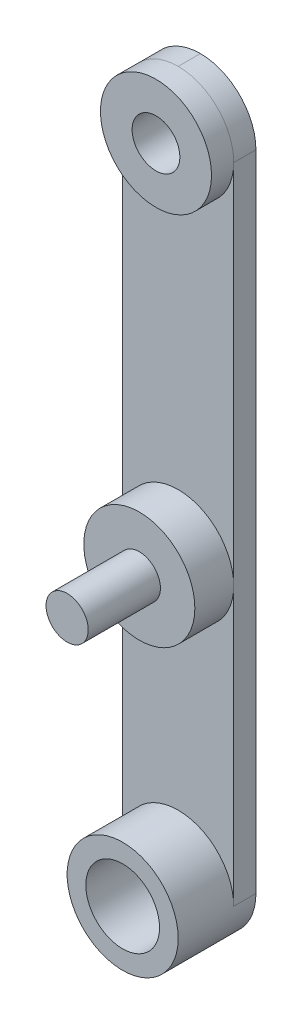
ISO-10303-21;
HEADER;
FILE_DESCRIPTION(('STEP AP214'),'2;1');
FILE_NAME('part.step','',(''),(''),'','','');
FILE_SCHEMA(('AUTOMOTIVE_DESIGN { 1 0 10303 214 1 1 1 1 }'));
ENDSEC;
DATA;
#1=APPLICATION_CONTEXT('core data for automotive mechanical design processes');
#2=APPLICATION_PROTOCOL_DEFINITION('international standard','automotive_design',2000,#1);
#3=PRODUCT_CONTEXT('',#1,'mechanical');
#4=PRODUCT('Part','Part','',(#3));
#5=PRODUCT_RELATED_PRODUCT_CATEGORY('part','',(#4));
#6=PRODUCT_DEFINITION_FORMATION('','',#4);
#7=PRODUCT_DEFINITION_CONTEXT('part definition',#1,'design');
#8=PRODUCT_DEFINITION('design','',#6,#7);
#9=PRODUCT_DEFINITION_SHAPE('','',#8);
#10=(LENGTH_UNIT() NAMED_UNIT(*) SI_UNIT(.MILLI.,.METRE.));
#11=(NAMED_UNIT(*) PLANE_ANGLE_UNIT() SI_UNIT($,.RADIAN.));
#12=(NAMED_UNIT(*) SI_UNIT($,.STERADIAN.) SOLID_ANGLE_UNIT());
#13=UNCERTAINTY_MEASURE_WITH_UNIT(LENGTH_MEASURE(1.E-05),#10,'distance_accuracy_value','');
#14=(GEOMETRIC_REPRESENTATION_CONTEXT(3) GLOBAL_UNCERTAINTY_ASSIGNED_CONTEXT((#13)) GLOBAL_UNIT_ASSIGNED_CONTEXT((#10,
#11,#12)) REPRESENTATION_CONTEXT('',''));
#15=CARTESIAN_POINT('',(0.,0.,0.));
#16=DIRECTION('',(0.,0.,1.));
#17=DIRECTION('',(1.,0.,0.));
#18=AXIS2_PLACEMENT_3D('',#15,#16,#17);
#19=CARTESIAN_POINT('',(0.,-25.,2.));
#20=DIRECTION('',(0.,0.,1.));
#21=DIRECTION('',(1.,0.,0.));
#22=AXIS2_PLACEMENT_3D('',#19,#20,#21);
#23=PLANE('',#22);
#24=DIRECTION('',(0.,1.,0.));
#25=VECTOR('',#24,1.);
#26=CARTESIAN_POINT('',(5.,38.,2.));
#27=LINE('',#26,#25);
#28=CARTESIAN_POINT('',(5.00000000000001,0.,2.));
#29=VERTEX_POINT('',#28);
#30=CARTESIAN_POINT('',(5.,33.,2.));
#31=VERTEX_POINT('',#30);
#32=EDGE_CURVE('E96',#29,#31,#27,.T.);
#33=ORIENTED_EDGE('',*,*,#32,.T.);
#34=CARTESIAN_POINT('',(0.,33.,2.));
#35=DIRECTION('',(0.,0.,1.));
#36=DIRECTION('',(1.,0.,0.));
#37=AXIS2_PLACEMENT_3D('',#34,#35,#36);
#38=CIRCLE('',#37,5.);
#39=CARTESIAN_POINT('',(-5.,33.,2.));
#40=VERTEX_POINT('',#39);
#41=EDGE_CURVE('E158',#31,#40,#38,.F.);
#42=ORIENTED_EDGE('',*,*,#41,.T.);
#43=DIRECTION('',(0.,-1.,0.));
#44=VECTOR('',#43,1.);
#45=CARTESIAN_POINT('',(-5.,38.,2.));
#46=LINE('',#45,#44);
#47=CARTESIAN_POINT('',(-5.,0.,2.));
#48=VERTEX_POINT('',#47);
#49=EDGE_CURVE('E148',#40,#48,#46,.T.);
#50=ORIENTED_EDGE('',*,*,#49,.T.);
#51=CARTESIAN_POINT('',(0.,0.,2.));
#52=DIRECTION('',(0.,0.,1.));
#53=DIRECTION('',(1.,0.,0.));
#54=AXIS2_PLACEMENT_3D('',#51,#52,#53);
#55=CIRCLE('',#54,5.);
#56=EDGE_CURVE('E141',#29,#48,#55,.T.);
#57=ORIENTED_EDGE('',*,*,#56,.F.);
#58=EDGE_LOOP('',(#33,#42,#50,#57));
#59=FACE_BOUND('',#58,.T.);
#60=ADVANCED_FACE('F35',(#59),#23,.T.);
#61=CARTESIAN_POINT('',(-4.99999999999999,-25.,2.));
#62=VERTEX_POINT('',#61);
#63=EDGE_CURVE('E113',#48,#62,#46,.T.);
#64=ORIENTED_EDGE('',*,*,#63,.T.);
#65=CARTESIAN_POINT('',(0.,-25.,2.));
#66=DIRECTION('',(0.,0.,1.));
#67=DIRECTION('',(1.,0.,0.));
#68=AXIS2_PLACEMENT_3D('',#65,#66,#67);
#69=CIRCLE('',#68,5.);
#70=CARTESIAN_POINT('',(5.00000000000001,-25.,2.));
#71=VERTEX_POINT('',#70);
#72=EDGE_CURVE('E106',#71,#62,#69,.T.);
#73=ORIENTED_EDGE('',*,*,#72,.F.);
#74=EDGE_CURVE('E90',#71,#29,#27,.T.);
#75=ORIENTED_EDGE('',*,*,#74,.T.);
#76=EDGE_CURVE('E135',#48,#29,#55,.T.);
#77=ORIENTED_EDGE('',*,*,#76,.F.);
#78=EDGE_LOOP('',(#64,#73,#75,#77));
#79=FACE_BOUND('',#78,.T.);
#80=ADVANCED_FACE('F111',(#79),#23,.T.);
#81=CARTESIAN_POINT('',(-5.,38.,2.));
#82=DIRECTION('',(1.,0.,0.));
#83=DIRECTION('',(0.,1.,0.));
#84=AXIS2_PLACEMENT_3D('',#81,#82,#83);
#85=PLANE('',#84);
#86=ORIENTED_EDGE('',*,*,#49,.F.);
#87=DIRECTION('',(0.,0.,-1.));
#88=VECTOR('',#87,1.);
#89=CARTESIAN_POINT('',(-5.,33.,2.));
#90=LINE('',#89,#88);
#91=CARTESIAN_POINT('',(-5.,33.,0.));
#92=VERTEX_POINT('',#91);
#93=EDGE_CURVE('E11',#40,#92,#90,.T.);
#94=ORIENTED_EDGE('',*,*,#93,.T.);
#95=DIRECTION('',(0.,-1.,0.));
#96=VECTOR('',#95,1.);
#97=CARTESIAN_POINT('',(-5.,38.,0.));
#98=LINE('',#97,#96);
#99=CARTESIAN_POINT('',(-4.99999999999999,-25.,0.));
#100=VERTEX_POINT('',#99);
#101=EDGE_CURVE('E147',#92,#100,#98,.T.);
#102=ORIENTED_EDGE('',*,*,#101,.T.);
#103=DIRECTION('',(0.,0.,-1.));
#104=VECTOR('',#103,1.);
#105=CARTESIAN_POINT('',(-4.99999999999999,-25.,2.));
#106=LINE('',#105,#104);
#107=EDGE_CURVE('E109',#62,#100,#106,.T.);
#108=ORIENTED_EDGE('',*,*,#107,.F.);
#109=ORIENTED_EDGE('',*,*,#63,.F.);
#110=EDGE_LOOP('',(#86,#94,#102,#108,#109));
#111=FACE_BOUND('',#110,.T.);
#112=ADVANCED_FACE('F175',(#111),#85,.F.);
#113=CARTESIAN_POINT('',(0.,-25.,2.));
#114=DIRECTION('',(0.,0.,-1.));
#115=DIRECTION('',(-1.,0.,0.));
#116=AXIS2_PLACEMENT_3D('',#113,#114,#115);
#117=CYLINDRICAL_SURFACE('',#116,5.);
#118=CARTESIAN_POINT('',(0.,-25.,0.));
#119=DIRECTION('',(0.,0.,1.));
#120=DIRECTION('',(1.,0.,0.));
#121=AXIS2_PLACEMENT_3D('',#118,#119,#120);
#122=CIRCLE('',#121,5.);
#123=CARTESIAN_POINT('',(5.00000000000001,-25.,0.));
#124=VERTEX_POINT('',#123);
#125=EDGE_CURVE('E108',#100,#124,#122,.T.);
#126=ORIENTED_EDGE('',*,*,#125,.T.);
#127=DIRECTION('',(0.,0.,-1.));
#128=VECTOR('',#127,1.);
#129=CARTESIAN_POINT('',(5.00000000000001,-25.,2.));
#130=LINE('',#129,#128);
#131=EDGE_CURVE('E93',#71,#124,#130,.T.);
#132=ORIENTED_EDGE('',*,*,#131,.F.);
#133=ORIENTED_EDGE('',*,*,#72,.T.);
#134=ORIENTED_EDGE('',*,*,#107,.T.);
#135=EDGE_LOOP('',(#126,#132,#133,#134));
#136=FACE_BOUND('',#135,.T.);
#137=CARTESIAN_POINT('',(0.,-25.,7.));
#138=DIRECTION('',(0.,0.,1.));
#139=DIRECTION('',(1.,0.,0.));
#140=AXIS2_PLACEMENT_3D('',#137,#138,#139);
#141=CIRCLE('',#140,5.);
#142=CARTESIAN_POINT('',(5.00000000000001,-25.,7.));
#143=VERTEX_POINT('',#142);
#144=EDGE_CURVE('E115',#143,#143,#141,.T.);
#145=ORIENTED_EDGE('',*,*,#144,.F.);
#146=EDGE_LOOP('',(#145));
#147=FACE_BOUND('',#146,.T.);
#148=ADVANCED_FACE('F103',(#136,#147),#117,.T.);
#149=CARTESIAN_POINT('',(5.,38.,2.));
#150=DIRECTION('',(-1.,0.,0.));
#151=DIRECTION('',(0.,-1.,0.));
#152=AXIS2_PLACEMENT_3D('',#149,#150,#151);
#153=PLANE('',#152);
#154=DIRECTION('',(0.,1.,0.));
#155=VECTOR('',#154,1.);
#156=CARTESIAN_POINT('',(5.,38.,0.));
#157=LINE('',#156,#155);
#158=CARTESIAN_POINT('',(5.,33.,0.));
#159=VERTEX_POINT('',#158);
#160=EDGE_CURVE('E152',#124,#159,#157,.T.);
#161=ORIENTED_EDGE('',*,*,#160,.T.);
#162=DIRECTION('',(0.,0.,-1.));
#163=VECTOR('',#162,1.);
#164=CARTESIAN_POINT('',(5.,33.,2.));
#165=LINE('',#164,#163);
#166=EDGE_CURVE('E44',#159,#31,#165,.F.);
#167=ORIENTED_EDGE('',*,*,#166,.T.);
#168=ORIENTED_EDGE('',*,*,#32,.F.);
#169=ORIENTED_EDGE('',*,*,#74,.F.);
#170=ORIENTED_EDGE('',*,*,#131,.T.);
#171=EDGE_LOOP('',(#161,#167,#168,#169,#170));
#172=FACE_BOUND('',#171,.T.);
#173=ADVANCED_FACE('F92',(#172),#153,.F.);
#174=CARTESIAN_POINT('',(0.,-25.,0.));
#175=DIRECTION('',(0.,0.,1.));
#176=DIRECTION('',(1.,0.,0.));
#177=AXIS2_PLACEMENT_3D('',#174,#175,#176);
#178=PLANE('',#177);
#179=CARTESIAN_POINT('',(0.,-25.,0.));
#180=DIRECTION('',(0.,0.,1.));
#181=DIRECTION('',(1.,0.,0.));
#182=AXIS2_PLACEMENT_3D('',#179,#180,#181);
#183=CIRCLE('',#182,3.31865234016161);
#184=CARTESIAN_POINT('',(3.31865234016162,-25.,0.));
#185=VERTEX_POINT('',#184);
#186=EDGE_CURVE('E116',#185,#185,#183,.T.);
#187=ORIENTED_EDGE('',*,*,#186,.T.);
#188=EDGE_LOOP('',(#187));
#189=FACE_BOUND('',#188,.T.);
#190=CARTESIAN_POINT('',(0.,33.,0.));
#191=DIRECTION('',(0.,0.,1.));
#192=DIRECTION('',(1.,0.,0.));
#193=AXIS2_PLACEMENT_3D('',#190,#191,#192);
#194=CIRCLE('',#193,2.15);
#195=CARTESIAN_POINT('',(2.15,33.,0.));
#196=VERTEX_POINT('',#195);
#197=EDGE_CURVE('E125',#196,#196,#194,.T.);
#198=ORIENTED_EDGE('',*,*,#197,.T.);
#199=EDGE_LOOP('',(#198));
#200=FACE_BOUND('',#199,.T.);
#201=CARTESIAN_POINT('',(0.,33.,0.));
#202=DIRECTION('',(0.,0.,1.));
#203=DIRECTION('',(1.,0.,0.));
#204=AXIS2_PLACEMENT_3D('',#201,#202,#203);
#205=CIRCLE('',#204,5.);
#206=CARTESIAN_POINT('',(0.,38.,0.));
#207=VERTEX_POINT('',#206);
#208=EDGE_CURVE('E56',#92,#207,#205,.F.);
#209=ORIENTED_EDGE('',*,*,#208,.T.);
#210=CARTESIAN_POINT('',(0.,33.,0.));
#211=DIRECTION('',(0.,0.,1.));
#212=DIRECTION('',(1.,0.,0.));
#213=AXIS2_PLACEMENT_3D('',#210,#211,#212);
#214=CIRCLE('',#213,5.);
#215=EDGE_CURVE('E51',#207,#159,#214,.F.);
#216=ORIENTED_EDGE('',*,*,#215,.T.);
#217=ORIENTED_EDGE('',*,*,#160,.F.);
#218=ORIENTED_EDGE('',*,*,#125,.F.);
#219=ORIENTED_EDGE('',*,*,#101,.F.);
#220=EDGE_LOOP('',(#209,#216,#217,#218,#219));
#221=FACE_BOUND('',#220,.T.);
#222=ADVANCED_FACE('F177',(#189,#200,#221),#178,.F.);
#223=CARTESIAN_POINT('',(0.,0.,5.5));
#224=DIRECTION('',(0.,0.,-1.));
#225=DIRECTION('',(-1.,0.,0.));
#226=AXIS2_PLACEMENT_3D('',#223,#224,#225);
#227=CYLINDRICAL_SURFACE('',#226,5.);
#228=CARTESIAN_POINT('',(0.,0.,5.5));
#229=DIRECTION('',(0.,0.,1.));
#230=DIRECTION('',(1.,0.,0.));
#231=AXIS2_PLACEMENT_3D('',#228,#229,#230);
#232=CIRCLE('',#231,5.);
#233=CARTESIAN_POINT('',(5.,0.,5.5));
#234=VERTEX_POINT('',#233);
#235=EDGE_CURVE('E137',#234,#234,#232,.T.);
#236=ORIENTED_EDGE('',*,*,#235,.F.);
#237=EDGE_LOOP('',(#236));
#238=FACE_BOUND('',#237,.T.);
#239=ORIENTED_EDGE('',*,*,#56,.T.);
#240=ORIENTED_EDGE('',*,*,#76,.T.);
#241=EDGE_LOOP('',(#239,#240));
#242=FACE_BOUND('',#241,.T.);
#243=ADVANCED_FACE('F173',(#238,#242),#227,.T.);
#244=CARTESIAN_POINT('',(0.,0.,5.5));
#245=DIRECTION('',(0.,0.,1.));
#246=DIRECTION('',(1.,0.,0.));
#247=AXIS2_PLACEMENT_3D('',#244,#245,#246);
#248=PLANE('',#247);
#249=CARTESIAN_POINT('',(0.,0.,5.5));
#250=DIRECTION('',(0.,0.,1.));
#251=DIRECTION('',(1.,0.,0.));
#252=AXIS2_PLACEMENT_3D('',#249,#250,#251);
#253=CIRCLE('',#252,1.9);
#254=CARTESIAN_POINT('',(1.9,0.,5.5));
#255=VERTEX_POINT('',#254);
#256=EDGE_CURVE('E140',#255,#255,#253,.T.);
#257=ORIENTED_EDGE('',*,*,#256,.F.);
#258=EDGE_LOOP('',(#257));
#259=FACE_BOUND('',#258,.T.);
#260=ORIENTED_EDGE('',*,*,#235,.T.);
#261=EDGE_LOOP('',(#260));
#262=FACE_BOUND('',#261,.T.);
#263=ADVANCED_FACE('F185',(#259,#262),#248,.T.);
#264=CARTESIAN_POINT('',(0.,0.,12.));
#265=DIRECTION('',(0.,0.,1.));
#266=DIRECTION('',(1.,0.,0.));
#267=AXIS2_PLACEMENT_3D('',#264,#265,#266);
#268=PLANE('',#267);
#269=CARTESIAN_POINT('',(0.,0.,12.));
#270=DIRECTION('',(0.,0.,1.));
#271=DIRECTION('',(1.,0.,0.));
#272=AXIS2_PLACEMENT_3D('',#269,#270,#271);
#273=CIRCLE('',#272,1.9);
#274=CARTESIAN_POINT('',(1.9,0.,12.));
#275=VERTEX_POINT('',#274);
#276=EDGE_CURVE('E144',#275,#275,#273,.T.);
#277=ORIENTED_EDGE('',*,*,#276,.T.);
#278=EDGE_LOOP('',(#277));
#279=FACE_BOUND('',#278,.T.);
#280=ADVANCED_FACE('F199',(#279),#268,.T.);
#281=CARTESIAN_POINT('',(0.,0.,12.));
#282=DIRECTION('',(0.,0.,-1.));
#283=DIRECTION('',(-1.,0.,0.));
#284=AXIS2_PLACEMENT_3D('',#281,#282,#283);
#285=CYLINDRICAL_SURFACE('',#284,1.9);
#286=ORIENTED_EDGE('',*,*,#256,.T.);
#287=EDGE_LOOP('',(#286));
#288=FACE_BOUND('',#287,.T.);
#289=ORIENTED_EDGE('',*,*,#276,.F.);
#290=EDGE_LOOP('',(#289));
#291=FACE_BOUND('',#290,.T.);
#292=ADVANCED_FACE('F196',(#288,#291),#285,.T.);
#293=CARTESIAN_POINT('',(0.,33.,4.));
#294=DIRECTION('',(0.,0.,-1.));
#295=DIRECTION('',(-1.,0.,0.));
#296=AXIS2_PLACEMENT_3D('',#293,#294,#295);
#297=CYLINDRICAL_SURFACE('',#296,5.);
#298=CARTESIAN_POINT('',(0.,33.,4.));
#299=DIRECTION('',(0.,0.,1.));
#300=DIRECTION('',(1.,0.,0.));
#301=AXIS2_PLACEMENT_3D('',#298,#299,#300);
#302=CIRCLE('',#301,5.);
#303=CARTESIAN_POINT('',(5.,33.,4.));
#304=VERTEX_POINT('',#303);
#305=EDGE_CURVE('E132',#304,#304,#302,.T.);
#306=ORIENTED_EDGE('',*,*,#305,.F.);
#307=EDGE_LOOP('',(#306));
#308=FACE_BOUND('',#307,.T.);
#309=CARTESIAN_POINT('',(0.,33.,2.));
#310=DIRECTION('',(0.,0.,1.));
#311=DIRECTION('',(1.,0.,0.));
#312=AXIS2_PLACEMENT_3D('',#309,#310,#311);
#313=CIRCLE('',#312,5.);
#314=CARTESIAN_POINT('',(0.,38.,2.));
#315=VERTEX_POINT('',#314);
#316=EDGE_CURVE('E128',#31,#315,#313,.T.);
#317=ORIENTED_EDGE('',*,*,#316,.T.);
#318=EDGE_CURVE('E155',#40,#315,#38,.F.);
#319=ORIENTED_EDGE('',*,*,#318,.F.);
#320=ORIENTED_EDGE('',*,*,#41,.F.);
#321=EDGE_LOOP('',(#317,#319,#320));
#322=FACE_BOUND('',#321,.T.);
#323=ADVANCED_FACE('F167',(#308,#322),#297,.T.);
#324=CARTESIAN_POINT('',(0.,33.,4.));
#325=DIRECTION('',(0.,0.,1.));
#326=DIRECTION('',(1.,0.,0.));
#327=AXIS2_PLACEMENT_3D('',#324,#325,#326);
#328=PLANE('',#327);
#329=CARTESIAN_POINT('',(0.,33.,4.));
#330=DIRECTION('',(0.,0.,1.));
#331=DIRECTION('',(1.,0.,0.));
#332=AXIS2_PLACEMENT_3D('',#329,#330,#331);
#333=CIRCLE('',#332,2.15);
#334=CARTESIAN_POINT('',(2.15,33.,4.));
#335=VERTEX_POINT('',#334);
#336=EDGE_CURVE('E129',#335,#335,#333,.T.);
#337=ORIENTED_EDGE('',*,*,#336,.F.);
#338=EDGE_LOOP('',(#337));
#339=FACE_BOUND('',#338,.T.);
#340=ORIENTED_EDGE('',*,*,#305,.T.);
#341=EDGE_LOOP('',(#340));
#342=FACE_BOUND('',#341,.T.);
#343=ADVANCED_FACE('F209',(#339,#342),#328,.T.);
#344=CARTESIAN_POINT('',(0.,33.,0.));
#345=DIRECTION('',(0.,0.,1.));
#346=DIRECTION('',(1.,0.,0.));
#347=AXIS2_PLACEMENT_3D('',#344,#345,#346);
#348=CYLINDRICAL_SURFACE('',#347,2.15);
#349=ORIENTED_EDGE('',*,*,#197,.F.);
#350=EDGE_LOOP('',(#349));
#351=FACE_BOUND('',#350,.T.);
#352=ORIENTED_EDGE('',*,*,#336,.T.);
#353=EDGE_LOOP('',(#352));
#354=FACE_BOUND('',#353,.T.);
#355=ADVANCED_FACE('F213',(#351,#354),#348,.F.);
#356=CARTESIAN_POINT('',(0.,33.,2.));
#357=DIRECTION('',(0.,0.,-1.));
#358=DIRECTION('',(-1.,0.,0.));
#359=AXIS2_PLACEMENT_3D('',#356,#357,#358);
#360=CYLINDRICAL_SURFACE('',#359,5.);
#361=ORIENTED_EDGE('',*,*,#93,.F.);
#362=ORIENTED_EDGE('',*,*,#318,.T.);
#363=DIRECTION('',(0.,0.,-1.));
#364=VECTOR('',#363,1.);
#365=CARTESIAN_POINT('',(0.,38.,2.));
#366=LINE('',#365,#364);
#367=EDGE_CURVE('E39',#207,#315,#366,.F.);
#368=ORIENTED_EDGE('',*,*,#367,.F.);
#369=ORIENTED_EDGE('',*,*,#208,.F.);
#370=EDGE_LOOP('',(#361,#362,#368,#369));
#371=FACE_BOUND('',#370,.T.);
#372=ADVANCED_FACE('F37',(#371),#360,.T.);
#373=CARTESIAN_POINT('',(0.,33.,2.));
#374=DIRECTION('',(0.,0.,-1.));
#375=DIRECTION('',(-1.,0.,0.));
#376=AXIS2_PLACEMENT_3D('',#373,#374,#375);
#377=CYLINDRICAL_SURFACE('',#376,5.);
#378=ORIENTED_EDGE('',*,*,#316,.F.);
#379=ORIENTED_EDGE('',*,*,#166,.F.);
#380=ORIENTED_EDGE('',*,*,#215,.F.);
#381=ORIENTED_EDGE('',*,*,#367,.T.);
#382=EDGE_LOOP('',(#378,#379,#380,#381));
#383=FACE_BOUND('',#382,.T.);
#384=ADVANCED_FACE('F222',(#383),#377,.T.);
#385=CARTESIAN_POINT('',(0.,-25.,7.));
#386=DIRECTION('',(0.,0.,1.));
#387=DIRECTION('',(1.,0.,0.));
#388=AXIS2_PLACEMENT_3D('',#385,#386,#387);
#389=PLANE('',#388);
#390=CARTESIAN_POINT('',(0.,-25.,7.));
#391=DIRECTION('',(0.,0.,1.));
#392=DIRECTION('',(1.,0.,0.));
#393=AXIS2_PLACEMENT_3D('',#390,#391,#392);
#394=CIRCLE('',#393,3.31865234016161);
#395=CARTESIAN_POINT('',(3.31865234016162,-25.,7.));
#396=VERTEX_POINT('',#395);
#397=EDGE_CURVE('E121',#396,#396,#394,.T.);
#398=ORIENTED_EDGE('',*,*,#397,.F.);
#399=EDGE_LOOP('',(#398));
#400=FACE_BOUND('',#399,.T.);
#401=ORIENTED_EDGE('',*,*,#144,.T.);
#402=EDGE_LOOP('',(#401));
#403=FACE_BOUND('',#402,.T.);
#404=ADVANCED_FACE('F218',(#400,#403),#389,.T.);
#405=CARTESIAN_POINT('',(0.,-25.,0.));
#406=DIRECTION('',(0.,0.,1.));
#407=DIRECTION('',(1.,0.,0.));
#408=AXIS2_PLACEMENT_3D('',#405,#406,#407);
#409=CYLINDRICAL_SURFACE('',#408,3.31865234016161);
#410=ORIENTED_EDGE('',*,*,#186,.F.);
#411=EDGE_LOOP('',(#410));
#412=FACE_BOUND('',#411,.T.);
#413=ORIENTED_EDGE('',*,*,#397,.T.);
#414=EDGE_LOOP('',(#413));
#415=FACE_BOUND('',#414,.T.);
#416=ADVANCED_FACE('F221',(#412,#415),#409,.F.);
#417=CLOSED_SHELL('',(#60,#80,#112,#148,#173,#222,#243,#263,#280,#292,#323,#343,#355,#372,#384,
#404,#416));
#418=MANIFOLD_SOLID_BREP('B2',#417);
#419=ADVANCED_BREP_SHAPE_REPRESENTATION('',(#18,#418),#14);
#420=SHAPE_DEFINITION_REPRESENTATION(#9,#419);
ENDSEC;
END-ISO-10303-21;
